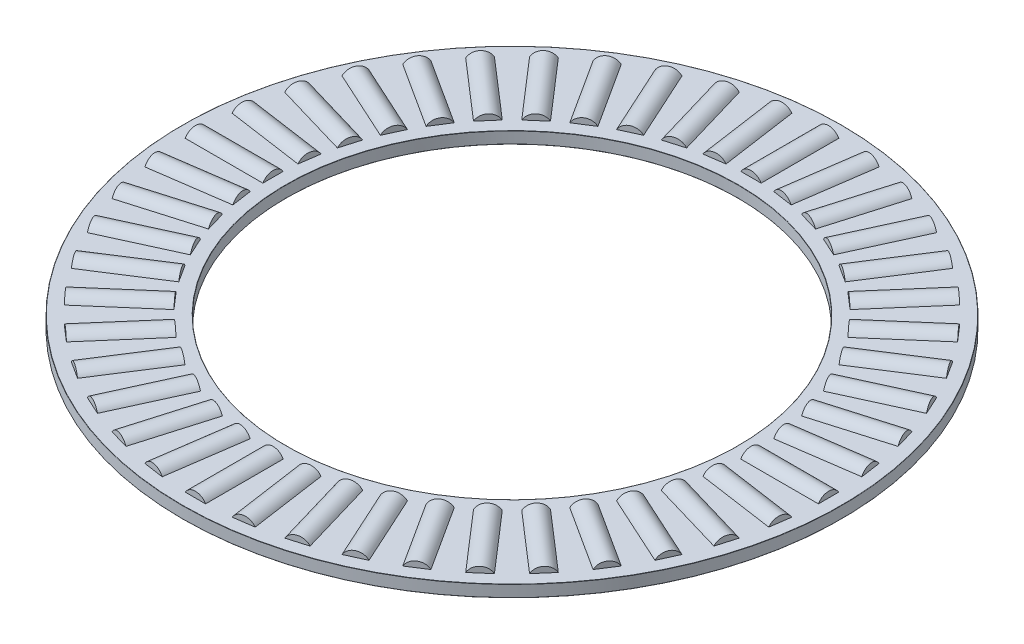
from build123d import *

# Parameters (mm, degrees)
SKETCH1_W         = 8.73125
SKETCH1_H         = 0.9921875
SKETCH3_W         = 6.5484375
SKETCH3_H         = 0.9921875
SKETCH2_W         = 6.5484375
SKETCH2_H         = 0.9921875
CIRPATTERN1_COUNT = 44
CIRPATTERN1_ANGLE = 351.818181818
CIRPATTERN2_COUNT = 44
FILLET2_R         = 0.01984375


with BuildPart() as part:
    # Sketch1 → Revolve1 (revolve)
    with BuildSketch(Plane(origin=(0, 0, 0), x_dir=(0, 0, -1), z_dir=(1, 0, 0)), mode=Mode.PRIVATE) as revolve1_sk:
        with Locations((-23.415625, 0)):
            Rectangle(SKETCH1_W, SKETCH1_H)
    revolve(revolve1_sk.sketch.rotate(Axis((0, -0.9921875, 0), (0, 1, 0)), 180), axis=Axis((0, -0.9921875, 0), (0, 1, 0)))

    # Sketch3 → Cut-Revolve1 (revolve, cut)
    with BuildSketch(Plane(origin=(0, 0, 0), x_dir=(0, 0, -1), z_dir=(1, 0, 0)), mode=Mode.PRIVATE) as cut_revolve1_sk:
        with Locations((-23.415625, 0.49609375)):
            Rectangle(SKETCH3_W, SKETCH3_H)
    cut_revolve1 = revolve(cut_revolve1_sk.sketch.rotate(Axis((0, 0, 26.68984375), (0, 0, -1)), 270), axis=Axis((0, 0, 26.68984375), (0, 0, -1)), mode=Mode.SUBTRACT)

    # CirPattern2: Cut-Revolve1 ×44 about axis
    cirpattern2_axis = Axis((0, 0.9921875, 0), (0, -1, 0))
    for i in range(1, CIRPATTERN2_COUNT):
        add(cut_revolve1.rotate(cirpattern2_axis, i * 360 / CIRPATTERN2_COUNT), mode=Mode.SUBTRACT)

    # Fillet2
    fillet2_edges = [part.edges().sort_by_distance(p)[0] for p in [
        (0, 0.49609375, 27.78125),
        (0, 0.49609375, 19.05),
        (0, -0.49609375, 27.78125),
        (0, -0.49609375, 19.05),
    ]]
    fillet(fillet2_edges, radius=FILLET2_R)


with BuildPart() as body_2:
    # Sketch2 → Revolve2 (revolve)
    with BuildSketch(Plane(origin=(0, 0, 0), x_dir=(0, 0, -1), z_dir=(1, 0, 0)), mode=Mode.PRIVATE) as revolve2_sk:
        with Locations((-23.415625, 0.49609375)):
            Rectangle(SKETCH2_W, SKETCH2_H)
    revolve(revolve2_sk.sketch.rotate(Axis((0, 0, 26.68984375), (0, 0, -1)), 270), axis=Axis((0, 0, 26.68984375), (0, 0, -1)))


with BuildPart() as cirpattern1_1:
    # CirPattern1: pattern copy
    add(body_2.part.rotate(Axis((0, 0.9921875, 0), (0, -1, 0)), 1 * CIRPATTERN1_ANGLE / (CIRPATTERN1_COUNT - 1)))


with BuildPart() as cirpattern1_2:
    # CirPattern1: pattern copy
    add(body_2.part.rotate(Axis((0, 0.9921875, 0), (0, -1, 0)), 2 * CIRPATTERN1_ANGLE / (CIRPATTERN1_COUNT - 1)))


with BuildPart() as cirpattern1_3:
    # CirPattern1: pattern copy
    add(body_2.part.rotate(Axis((0, 0.9921875, 0), (0, -1, 0)), 3 * CIRPATTERN1_ANGLE / (CIRPATTERN1_COUNT - 1)))


with BuildPart() as cirpattern1_4:
    # CirPattern1: pattern copy
    add(body_2.part.rotate(Axis((0, 0.9921875, 0), (0, -1, 0)), 4 * CIRPATTERN1_ANGLE / (CIRPATTERN1_COUNT - 1)))


with BuildPart() as cirpattern1_5:
    # CirPattern1: pattern copy
    add(body_2.part.rotate(Axis((0, 0.9921875, 0), (0, -1, 0)), 5 * CIRPATTERN1_ANGLE / (CIRPATTERN1_COUNT - 1)))


with BuildPart() as cirpattern1_6:
    # CirPattern1: pattern copy
    add(body_2.part.rotate(Axis((0, 0.9921875, 0), (0, -1, 0)), 6 * CIRPATTERN1_ANGLE / (CIRPATTERN1_COUNT - 1)))


with BuildPart() as cirpattern1_7:
    # CirPattern1: pattern copy
    add(body_2.part.rotate(Axis((0, 0.9921875, 0), (0, -1, 0)), 7 * CIRPATTERN1_ANGLE / (CIRPATTERN1_COUNT - 1)))


with BuildPart() as cirpattern1_8:
    # CirPattern1: pattern copy
    add(body_2.part.rotate(Axis((0, 0.9921875, 0), (0, -1, 0)), 8 * CIRPATTERN1_ANGLE / (CIRPATTERN1_COUNT - 1)))


with BuildPart() as cirpattern1_9:
    # CirPattern1: pattern copy
    add(body_2.part.rotate(Axis((0, 0.9921875, 0), (0, -1, 0)), 9 * CIRPATTERN1_ANGLE / (CIRPATTERN1_COUNT - 1)))


with BuildPart() as cirpattern1_10:
    # CirPattern1: pattern copy
    add(body_2.part.rotate(Axis((0, 0.9921875, 0), (0, -1, 0)), 10 * CIRPATTERN1_ANGLE / (CIRPATTERN1_COUNT - 1)))


with BuildPart() as cirpattern1_11:
    # CirPattern1: pattern copy
    add(body_2.part.rotate(Axis((0, 0.9921875, 0), (0, -1, 0)), 11 * CIRPATTERN1_ANGLE / (CIRPATTERN1_COUNT - 1)))


with BuildPart() as cirpattern1_12:
    # CirPattern1: pattern copy
    add(body_2.part.rotate(Axis((0, 0.9921875, 0), (0, -1, 0)), 12 * CIRPATTERN1_ANGLE / (CIRPATTERN1_COUNT - 1)))


with BuildPart() as cirpattern1_13:
    # CirPattern1: pattern copy
    add(body_2.part.rotate(Axis((0, 0.9921875, 0), (0, -1, 0)), 13 * CIRPATTERN1_ANGLE / (CIRPATTERN1_COUNT - 1)))


with BuildPart() as cirpattern1_14:
    # CirPattern1: pattern copy
    add(body_2.part.rotate(Axis((0, 0.9921875, 0), (0, -1, 0)), 14 * CIRPATTERN1_ANGLE / (CIRPATTERN1_COUNT - 1)))


with BuildPart() as cirpattern1_15:
    # CirPattern1: pattern copy
    add(body_2.part.rotate(Axis((0, 0.9921875, 0), (0, -1, 0)), 15 * CIRPATTERN1_ANGLE / (CIRPATTERN1_COUNT - 1)))


with BuildPart() as cirpattern1_16:
    # CirPattern1: pattern copy
    add(body_2.part.rotate(Axis((0, 0.9921875, 0), (0, -1, 0)), 16 * CIRPATTERN1_ANGLE / (CIRPATTERN1_COUNT - 1)))


with BuildPart() as cirpattern1_17:
    # CirPattern1: pattern copy
    add(body_2.part.rotate(Axis((0, 0.9921875, 0), (0, -1, 0)), 17 * CIRPATTERN1_ANGLE / (CIRPATTERN1_COUNT - 1)))


with BuildPart() as cirpattern1_18:
    # CirPattern1: pattern copy
    add(body_2.part.rotate(Axis((0, 0.9921875, 0), (0, -1, 0)), 18 * CIRPATTERN1_ANGLE / (CIRPATTERN1_COUNT - 1)))


with BuildPart() as cirpattern1_19:
    # CirPattern1: pattern copy
    add(body_2.part.rotate(Axis((0, 0.9921875, 0), (0, -1, 0)), 19 * CIRPATTERN1_ANGLE / (CIRPATTERN1_COUNT - 1)))


with BuildPart() as cirpattern1_20:
    # CirPattern1: pattern copy
    add(body_2.part.rotate(Axis((0, 0.9921875, 0), (0, -1, 0)), 20 * CIRPATTERN1_ANGLE / (CIRPATTERN1_COUNT - 1)))


with BuildPart() as cirpattern1_21:
    # CirPattern1: pattern copy
    add(body_2.part.rotate(Axis((0, 0.9921875, 0), (0, -1, 0)), 21 * CIRPATTERN1_ANGLE / (CIRPATTERN1_COUNT - 1)))


with BuildPart() as cirpattern1_22:
    # CirPattern1: pattern copy
    add(body_2.part.rotate(Axis((0, 0.9921875, 0), (0, -1, 0)), 22 * CIRPATTERN1_ANGLE / (CIRPATTERN1_COUNT - 1)))


with BuildPart() as cirpattern1_23:
    # CirPattern1: pattern copy
    add(body_2.part.rotate(Axis((0, 0.9921875, 0), (0, -1, 0)), 23 * CIRPATTERN1_ANGLE / (CIRPATTERN1_COUNT - 1)))


with BuildPart() as cirpattern1_24:
    # CirPattern1: pattern copy
    add(body_2.part.rotate(Axis((0, 0.9921875, 0), (0, -1, 0)), 24 * CIRPATTERN1_ANGLE / (CIRPATTERN1_COUNT - 1)))


with BuildPart() as cirpattern1_25:
    # CirPattern1: pattern copy
    add(body_2.part.rotate(Axis((0, 0.9921875, 0), (0, -1, 0)), 25 * CIRPATTERN1_ANGLE / (CIRPATTERN1_COUNT - 1)))


with BuildPart() as cirpattern1_26:
    # CirPattern1: pattern copy
    add(body_2.part.rotate(Axis((0, 0.9921875, 0), (0, -1, 0)), 26 * CIRPATTERN1_ANGLE / (CIRPATTERN1_COUNT - 1)))


with BuildPart() as cirpattern1_27:
    # CirPattern1: pattern copy
    add(body_2.part.rotate(Axis((0, 0.9921875, 0), (0, -1, 0)), 27 * CIRPATTERN1_ANGLE / (CIRPATTERN1_COUNT - 1)))


with BuildPart() as cirpattern1_28:
    # CirPattern1: pattern copy
    add(body_2.part.rotate(Axis((0, 0.9921875, 0), (0, -1, 0)), 28 * CIRPATTERN1_ANGLE / (CIRPATTERN1_COUNT - 1)))


with BuildPart() as cirpattern1_29:
    # CirPattern1: pattern copy
    add(body_2.part.rotate(Axis((0, 0.9921875, 0), (0, -1, 0)), 29 * CIRPATTERN1_ANGLE / (CIRPATTERN1_COUNT - 1)))


with BuildPart() as cirpattern1_30:
    # CirPattern1: pattern copy
    add(body_2.part.rotate(Axis((0, 0.9921875, 0), (0, -1, 0)), 30 * CIRPATTERN1_ANGLE / (CIRPATTERN1_COUNT - 1)))


with BuildPart() as cirpattern1_31:
    # CirPattern1: pattern copy
    add(body_2.part.rotate(Axis((0, 0.9921875, 0), (0, -1, 0)), 31 * CIRPATTERN1_ANGLE / (CIRPATTERN1_COUNT - 1)))


with BuildPart() as cirpattern1_32:
    # CirPattern1: pattern copy
    add(body_2.part.rotate(Axis((0, 0.9921875, 0), (0, -1, 0)), 32 * CIRPATTERN1_ANGLE / (CIRPATTERN1_COUNT - 1)))


with BuildPart() as cirpattern1_33:
    # CirPattern1: pattern copy
    add(body_2.part.rotate(Axis((0, 0.9921875, 0), (0, -1, 0)), 33 * CIRPATTERN1_ANGLE / (CIRPATTERN1_COUNT - 1)))


with BuildPart() as cirpattern1_34:
    # CirPattern1: pattern copy
    add(body_2.part.rotate(Axis((0, 0.9921875, 0), (0, -1, 0)), 34 * CIRPATTERN1_ANGLE / (CIRPATTERN1_COUNT - 1)))


with BuildPart() as cirpattern1_35:
    # CirPattern1: pattern copy
    add(body_2.part.rotate(Axis((0, 0.9921875, 0), (0, -1, 0)), 35 * CIRPATTERN1_ANGLE / (CIRPATTERN1_COUNT - 1)))


with BuildPart() as cirpattern1_36:
    # CirPattern1: pattern copy
    add(body_2.part.rotate(Axis((0, 0.9921875, 0), (0, -1, 0)), 36 * CIRPATTERN1_ANGLE / (CIRPATTERN1_COUNT - 1)))


with BuildPart() as cirpattern1_37:
    # CirPattern1: pattern copy
    add(body_2.part.rotate(Axis((0, 0.9921875, 0), (0, -1, 0)), 37 * CIRPATTERN1_ANGLE / (CIRPATTERN1_COUNT - 1)))


with BuildPart() as cirpattern1_38:
    # CirPattern1: pattern copy
    add(body_2.part.rotate(Axis((0, 0.9921875, 0), (0, -1, 0)), 38 * CIRPATTERN1_ANGLE / (CIRPATTERN1_COUNT - 1)))


with BuildPart() as cirpattern1_39:
    # CirPattern1: pattern copy
    add(body_2.part.rotate(Axis((0, 0.9921875, 0), (0, -1, 0)), 39 * CIRPATTERN1_ANGLE / (CIRPATTERN1_COUNT - 1)))


with BuildPart() as cirpattern1_40:
    # CirPattern1: pattern copy
    add(body_2.part.rotate(Axis((0, 0.9921875, 0), (0, -1, 0)), 40 * CIRPATTERN1_ANGLE / (CIRPATTERN1_COUNT - 1)))


with BuildPart() as cirpattern1_41:
    # CirPattern1: pattern copy
    add(body_2.part.rotate(Axis((0, 0.9921875, 0), (0, -1, 0)), 41 * CIRPATTERN1_ANGLE / (CIRPATTERN1_COUNT - 1)))


with BuildPart() as cirpattern1_42:
    # CirPattern1: pattern copy
    add(body_2.part.rotate(Axis((0, 0.9921875, 0), (0, -1, 0)), 42 * CIRPATTERN1_ANGLE / (CIRPATTERN1_COUNT - 1)))


with BuildPart() as cirpattern1_43:
    # CirPattern1: pattern copy
    add(body_2.part.rotate(Axis((0, 0.9921875, 0), (0, -1, 0)), 43 * CIRPATTERN1_ANGLE / (CIRPATTERN1_COUNT - 1)))


solid = Compound([part.part, body_2.part, cirpattern1_1.part, cirpattern1_2.part, cirpattern1_3.part, cirpattern1_4.part, cirpattern1_5.part, cirpattern1_6.part, cirpattern1_7.part, cirpattern1_8.part, cirpattern1_9.part, cirpattern1_10.part, cirpattern1_11.part, cirpattern1_12.part, cirpattern1_13.part, cirpattern1_14.part, cirpattern1_15.part, cirpattern1_16.part, cirpattern1_17.part, cirpattern1_18.part, cirpattern1_19.part, cirpattern1_20.part, cirpattern1_21.part, cirpattern1_22.part, cirpattern1_23.part, cirpattern1_24.part, cirpattern1_25.part, cirpattern1_26.part, cirpattern1_27.part, cirpattern1_28.part, cirpattern1_29.part, cirpattern1_30.part, cirpattern1_31.part, cirpattern1_32.part, cirpattern1_33.part, cirpattern1_34.part, cirpattern1_35.part, cirpattern1_36.part, cirpattern1_37.part, cirpattern1_38.part, cirpattern1_39.part, cirpattern1_40.part, cirpattern1_41.part, cirpattern1_42.part, cirpattern1_43.part])
